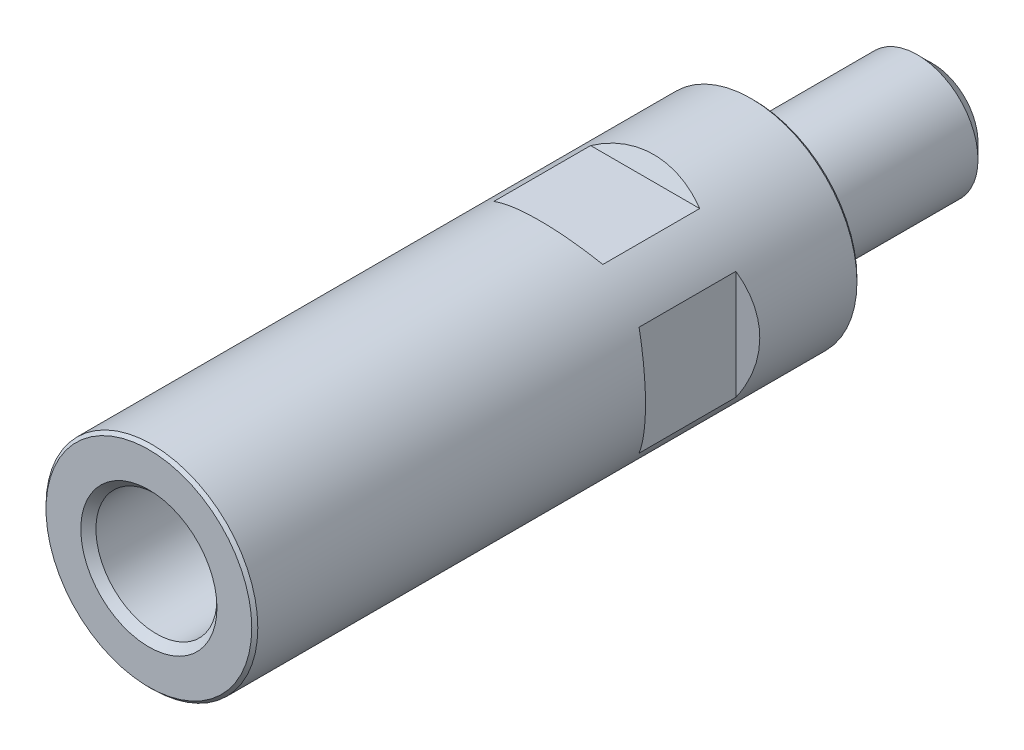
ISO-10303-21;
HEADER;
FILE_DESCRIPTION(('STEP AP214'),'2;1');
FILE_NAME('part.step','',(''),(''),'','','');
FILE_SCHEMA(('AUTOMOTIVE_DESIGN { 1 0 10303 214 1 1 1 1 }'));
ENDSEC;
DATA;
#1=APPLICATION_CONTEXT('core data for automotive mechanical design processes');
#2=APPLICATION_PROTOCOL_DEFINITION('international standard','automotive_design',2000,#1);
#3=PRODUCT_CONTEXT('',#1,'mechanical');
#4=PRODUCT('Part','Part','',(#3));
#5=PRODUCT_RELATED_PRODUCT_CATEGORY('part','',(#4));
#6=PRODUCT_DEFINITION_FORMATION('','',#4);
#7=PRODUCT_DEFINITION_CONTEXT('part definition',#1,'design');
#8=PRODUCT_DEFINITION('design','',#6,#7);
#9=PRODUCT_DEFINITION_SHAPE('','',#8);
#10=(LENGTH_UNIT() NAMED_UNIT(*) SI_UNIT(.MILLI.,.METRE.));
#11=(NAMED_UNIT(*) PLANE_ANGLE_UNIT() SI_UNIT($,.RADIAN.));
#12=(NAMED_UNIT(*) SI_UNIT($,.STERADIAN.) SOLID_ANGLE_UNIT());
#13=UNCERTAINTY_MEASURE_WITH_UNIT(LENGTH_MEASURE(1.E-05),#10,'distance_accuracy_value','');
#14=(GEOMETRIC_REPRESENTATION_CONTEXT(3) GLOBAL_UNCERTAINTY_ASSIGNED_CONTEXT((#13)) GLOBAL_UNIT_ASSIGNED_CONTEXT((#10,
#11,#12)) REPRESENTATION_CONTEXT('',''));
#15=CARTESIAN_POINT('',(0.,0.,0.));
#16=DIRECTION('',(0.,0.,1.));
#17=DIRECTION('',(1.,0.,0.));
#18=AXIS2_PLACEMENT_3D('',#15,#16,#17);
#19=CARTESIAN_POINT('',(0.,0.,2.5));
#20=DIRECTION('',(0.,0.,-1.));
#21=DIRECTION('',(-1.,0.,0.));
#22=AXIS2_PLACEMENT_3D('',#19,#20,#21);
#23=CONICAL_SURFACE('',#22,8.75,0.785398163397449);
#24=CARTESIAN_POINT('',(0.,0.,0.));
#25=DIRECTION('',(0.,0.,1.));
#26=DIRECTION('',(1.,0.,0.));
#27=AXIS2_PLACEMENT_3D('',#24,#25,#26);
#28=CIRCLE('',#27,11.25);
#29=CARTESIAN_POINT('',(11.25,0.,0.));
#30=VERTEX_POINT('',#29);
#31=EDGE_CURVE('E106',#30,#30,#28,.T.);
#32=ORIENTED_EDGE('',*,*,#31,.F.);
#33=EDGE_LOOP('',(#32));
#34=FACE_BOUND('',#33,.T.);
#35=CARTESIAN_POINT('',(0.,0.,1.25));
#36=DIRECTION('',(0.,0.,-1.));
#37=DIRECTION('',(-1.,0.,0.));
#38=AXIS2_PLACEMENT_3D('',#35,#36,#37);
#39=CIRCLE('',#38,10.);
#40=CARTESIAN_POINT('',(-10.,0.,1.25));
#41=VERTEX_POINT('',#40);
#42=EDGE_CURVE('E10',#41,#41,#39,.T.);
#43=ORIENTED_EDGE('',*,*,#42,.F.);
#44=EDGE_LOOP('',(#43));
#45=FACE_BOUND('',#44,.T.);
#46=ADVANCED_FACE('F16',(#34,#45),#23,.F.);
#47=CARTESIAN_POINT('',(0.,0.,100.));
#48=DIRECTION('',(0.,0.,-1.));
#49=DIRECTION('',(-1.,0.,0.));
#50=AXIS2_PLACEMENT_3D('',#47,#48,#49);
#51=CYLINDRICAL_SURFACE('',#50,17.5);
#52=CARTESIAN_POINT('',(0.,0.,0.499999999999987));
#53=DIRECTION('',(0.,0.,1.));
#54=DIRECTION('',(1.,0.,0.));
#55=AXIS2_PLACEMENT_3D('',#52,#53,#54);
#56=CIRCLE('',#55,17.5);
#57=CARTESIAN_POINT('',(17.5,0.,0.499999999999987));
#58=VERTEX_POINT('',#57);
#59=EDGE_CURVE('E163',#58,#58,#56,.T.);
#60=ORIENTED_EDGE('',*,*,#59,.T.);
#61=EDGE_LOOP('',(#60));
#62=FACE_BOUND('',#61,.T.);
#63=CARTESIAN_POINT('',(0.,0.,99.5));
#64=DIRECTION('',(0.,0.,1.));
#65=DIRECTION('',(1.,0.,0.));
#66=AXIS2_PLACEMENT_3D('',#63,#64,#65);
#67=CIRCLE('',#66,17.5);
#68=CARTESIAN_POINT('',(17.5,0.,99.5));
#69=VERTEX_POINT('',#68);
#70=EDGE_CURVE('E102',#69,#69,#67,.F.);
#71=ORIENTED_EDGE('',*,*,#70,.T.);
#72=EDGE_LOOP('',(#71));
#73=FACE_BOUND('',#72,.T.);
#74=CARTESIAN_POINT('',(0.,0.,26.6602540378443));
#75=DIRECTION('',(0.5,0.,-0.86602540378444));
#76=DIRECTION('',(-0.86602540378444,0.,-0.5));
#77=AXIS2_PLACEMENT_3D('',#74,#75,#76);
#78=ELLIPSE('',#77,20.2072594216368,17.5);
#79=CARTESIAN_POINT('',(-15.,-9.01387818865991,18.));
#80=VERTEX_POINT('',#79);
#81=CARTESIAN_POINT('',(-15.,9.01387818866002,18.));
#82=VERTEX_POINT('',#81);
#83=EDGE_CURVE('E84',#80,#82,#78,.T.);
#84=ORIENTED_EDGE('',*,*,#83,.T.);
#85=DIRECTION('',(0.,0.,-1.));
#86=VECTOR('',#85,1.);
#87=CARTESIAN_POINT('',(-15.,9.01387818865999,100.));
#88=LINE('',#87,#86);
#89=CARTESIAN_POINT('',(-15.,9.01387818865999,34.));
#90=VERTEX_POINT('',#89);
#91=EDGE_CURVE('E89',#82,#90,#88,.F.);
#92=ORIENTED_EDGE('',*,*,#91,.T.);
#93=CARTESIAN_POINT('',(0.,0.,25.3397459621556));
#94=DIRECTION('',(0.5,0.,0.86602540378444));
#95=DIRECTION('',(0.86602540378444,0.,-0.5));
#96=AXIS2_PLACEMENT_3D('',#93,#94,#95);
#97=ELLIPSE('',#96,20.2072594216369,17.5);
#98=CARTESIAN_POINT('',(-15.,-9.01387818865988,34.));
#99=VERTEX_POINT('',#98);
#100=EDGE_CURVE('E103',#90,#99,#97,.T.);
#101=ORIENTED_EDGE('',*,*,#100,.T.);
#102=DIRECTION('',(0.,0.,-1.));
#103=VECTOR('',#102,1.);
#104=CARTESIAN_POINT('',(-15.,-9.01387818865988,100.));
#105=LINE('',#104,#103);
#106=EDGE_CURVE('E90',#99,#80,#105,.T.);
#107=ORIENTED_EDGE('',*,*,#106,.T.);
#108=EDGE_LOOP('',(#84,#92,#101,#107));
#109=FACE_BOUND('',#108,.T.);
#110=CARTESIAN_POINT('',(0.,0.,26.6602540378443));
#111=DIRECTION('',(-0.5,0.,-0.86602540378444));
#112=DIRECTION('',(0.86602540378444,0.,-0.5));
#113=AXIS2_PLACEMENT_3D('',#110,#111,#112);
#114=ELLIPSE('',#113,20.2072594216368,17.5);
#115=CARTESIAN_POINT('',(15.,9.01387818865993,18.));
#116=VERTEX_POINT('',#115);
#117=CARTESIAN_POINT('',(15.,-9.01387818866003,18.));
#118=VERTEX_POINT('',#117);
#119=EDGE_CURVE('E94',#116,#118,#114,.T.);
#120=ORIENTED_EDGE('',*,*,#119,.T.);
#121=DIRECTION('',(0.,0.,-1.));
#122=VECTOR('',#121,1.);
#123=CARTESIAN_POINT('',(15.,-9.01387818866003,100.));
#124=LINE('',#123,#122);
#125=CARTESIAN_POINT('',(15.,-9.01387818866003,34.));
#126=VERTEX_POINT('',#125);
#127=EDGE_CURVE('E152',#118,#126,#124,.F.);
#128=ORIENTED_EDGE('',*,*,#127,.T.);
#129=CARTESIAN_POINT('',(0.,0.,25.3397459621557));
#130=DIRECTION('',(-0.5,0.,0.86602540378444));
#131=DIRECTION('',(-0.86602540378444,0.,-0.5));
#132=AXIS2_PLACEMENT_3D('',#129,#130,#131);
#133=ELLIPSE('',#132,20.2072594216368,17.5);
#134=CARTESIAN_POINT('',(15.,9.01387818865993,34.));
#135=VERTEX_POINT('',#134);
#136=EDGE_CURVE('E149',#126,#135,#133,.T.);
#137=ORIENTED_EDGE('',*,*,#136,.T.);
#138=DIRECTION('',(0.,0.,-1.));
#139=VECTOR('',#138,1.);
#140=CARTESIAN_POINT('',(15.,9.01387818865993,100.));
#141=LINE('',#140,#139);
#142=EDGE_CURVE('E155',#135,#116,#141,.T.);
#143=ORIENTED_EDGE('',*,*,#142,.T.);
#144=EDGE_LOOP('',(#120,#128,#137,#143));
#145=FACE_BOUND('',#144,.T.);
#146=CARTESIAN_POINT('',(0.,0.,26.6602540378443));
#147=DIRECTION('',(0.,0.5,-0.86602540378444));
#148=DIRECTION('',(0.,-0.86602540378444,-0.5));
#149=AXIS2_PLACEMENT_3D('',#146,#147,#148);
#150=ELLIPSE('',#149,20.2072594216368,17.5);
#151=CARTESIAN_POINT('',(9.01387818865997,-15.,18.));
#152=VERTEX_POINT('',#151);
#153=CARTESIAN_POINT('',(-9.01387818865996,-15.,18.));
#154=VERTEX_POINT('',#153);
#155=EDGE_CURVE('E138',#152,#154,#150,.T.);
#156=ORIENTED_EDGE('',*,*,#155,.T.);
#157=DIRECTION('',(0.,0.,-1.));
#158=VECTOR('',#157,1.);
#159=CARTESIAN_POINT('',(-9.01387818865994,-15.,100.));
#160=LINE('',#159,#158);
#161=CARTESIAN_POINT('',(-9.01387818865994,-15.,34.));
#162=VERTEX_POINT('',#161);
#163=EDGE_CURVE('E146',#154,#162,#160,.F.);
#164=ORIENTED_EDGE('',*,*,#163,.T.);
#165=CARTESIAN_POINT('',(0.,0.,25.3397459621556));
#166=DIRECTION('',(0.,0.5,0.86602540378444));
#167=DIRECTION('',(0.,0.86602540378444,-0.5));
#168=AXIS2_PLACEMENT_3D('',#165,#166,#167);
#169=ELLIPSE('',#168,20.2072594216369,17.5);
#170=CARTESIAN_POINT('',(9.01387818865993,-15.,34.));
#171=VERTEX_POINT('',#170);
#172=EDGE_CURVE('E143',#162,#171,#169,.T.);
#173=ORIENTED_EDGE('',*,*,#172,.T.);
#174=DIRECTION('',(0.,0.,-1.));
#175=VECTOR('',#174,1.);
#176=CARTESIAN_POINT('',(9.01387818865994,-15.,100.));
#177=LINE('',#176,#175);
#178=EDGE_CURVE('E140',#171,#152,#177,.T.);
#179=ORIENTED_EDGE('',*,*,#178,.T.);
#180=EDGE_LOOP('',(#156,#164,#173,#179));
#181=FACE_BOUND('',#180,.T.);
#182=CARTESIAN_POINT('',(0.,0.,26.6602540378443));
#183=DIRECTION('',(0.,-0.5,-0.86602540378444));
#184=DIRECTION('',(0.,0.86602540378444,-0.5));
#185=AXIS2_PLACEMENT_3D('',#182,#183,#184);
#186=ELLIPSE('',#185,20.2072594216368,17.5);
#187=CARTESIAN_POINT('',(-9.01387818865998,15.,18.));
#188=VERTEX_POINT('',#187);
#189=CARTESIAN_POINT('',(9.01387818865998,15.,18.));
#190=VERTEX_POINT('',#189);
#191=EDGE_CURVE('E136',#188,#190,#186,.T.);
#192=ORIENTED_EDGE('',*,*,#191,.T.);
#193=DIRECTION('',(0.,0.,-1.));
#194=VECTOR('',#193,1.);
#195=CARTESIAN_POINT('',(9.01387818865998,15.,100.));
#196=LINE('',#195,#194);
#197=CARTESIAN_POINT('',(9.01387818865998,15.,34.));
#198=VERTEX_POINT('',#197);
#199=EDGE_CURVE('E130',#190,#198,#196,.F.);
#200=ORIENTED_EDGE('',*,*,#199,.T.);
#201=CARTESIAN_POINT('',(0.,0.,25.3397459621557));
#202=DIRECTION('',(0.,-0.5,0.86602540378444));
#203=DIRECTION('',(0.,-0.86602540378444,-0.5));
#204=AXIS2_PLACEMENT_3D('',#201,#202,#203);
#205=ELLIPSE('',#204,20.2072594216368,17.5);
#206=CARTESIAN_POINT('',(-9.01387818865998,15.,34.));
#207=VERTEX_POINT('',#206);
#208=EDGE_CURVE('E126',#198,#207,#205,.T.);
#209=ORIENTED_EDGE('',*,*,#208,.T.);
#210=DIRECTION('',(0.,0.,-1.));
#211=VECTOR('',#210,1.);
#212=CARTESIAN_POINT('',(-9.01387818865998,15.,100.));
#213=LINE('',#212,#211);
#214=EDGE_CURVE('E133',#207,#188,#213,.T.);
#215=ORIENTED_EDGE('',*,*,#214,.T.);
#216=EDGE_LOOP('',(#192,#200,#209,#215));
#217=FACE_BOUND('',#216,.T.);
#218=ADVANCED_FACE('F86',(#62,#73,#109,#145,#181,#217),#51,.T.);
#219=CARTESIAN_POINT('',(0.,0.,100.));
#220=DIRECTION('',(0.,0.,1.));
#221=DIRECTION('',(1.,0.,0.));
#222=AXIS2_PLACEMENT_3D('',#219,#220,#221);
#223=PLANE('',#222);
#224=CARTESIAN_POINT('',(0.,0.,100.));
#225=DIRECTION('',(0.,0.,1.));
#226=DIRECTION('',(1.,0.,0.));
#227=AXIS2_PLACEMENT_3D('',#224,#225,#226);
#228=CIRCLE('',#227,17.);
#229=CARTESIAN_POINT('',(17.,0.,100.));
#230=VERTEX_POINT('',#229);
#231=EDGE_CURVE('E26',#230,#230,#228,.T.);
#232=ORIENTED_EDGE('',*,*,#231,.T.);
#233=EDGE_LOOP('',(#232));
#234=FACE_BOUND('',#233,.T.);
#235=CARTESIAN_POINT('',(0.,0.,100.));
#236=DIRECTION('',(0.,0.,1.));
#237=DIRECTION('',(1.,0.,0.));
#238=AXIS2_PLACEMENT_3D('',#235,#236,#237);
#239=CIRCLE('',#238,11.25);
#240=CARTESIAN_POINT('',(11.25,0.,100.));
#241=VERTEX_POINT('',#240);
#242=EDGE_CURVE('E110',#241,#241,#239,.T.);
#243=ORIENTED_EDGE('',*,*,#242,.F.);
#244=EDGE_LOOP('',(#243));
#245=FACE_BOUND('',#244,.T.);
#246=ADVANCED_FACE('F230',(#234,#245),#223,.T.);
#247=CARTESIAN_POINT('',(0.,0.,0.));
#248=DIRECTION('',(0.,0.,1.));
#249=DIRECTION('',(1.,0.,0.));
#250=AXIS2_PLACEMENT_3D('',#247,#248,#249);
#251=PLANE('',#250);
#252=CARTESIAN_POINT('',(0.,0.,0.));
#253=DIRECTION('',(0.,0.,1.));
#254=DIRECTION('',(1.,0.,0.));
#255=AXIS2_PLACEMENT_3D('',#252,#253,#254);
#256=CIRCLE('',#255,17.);
#257=CARTESIAN_POINT('',(17.,0.,0.));
#258=VERTEX_POINT('',#257);
#259=EDGE_CURVE('E166',#258,#258,#256,.F.);
#260=ORIENTED_EDGE('',*,*,#259,.T.);
#261=EDGE_LOOP('',(#260));
#262=FACE_BOUND('',#261,.T.);
#263=ORIENTED_EDGE('',*,*,#31,.T.);
#264=EDGE_LOOP('',(#263));
#265=FACE_BOUND('',#264,.T.);
#266=ADVANCED_FACE('F273',(#262,#265),#251,.F.);
#267=CARTESIAN_POINT('',(-10.,15.,18.));
#268=DIRECTION('',(0.,-0.5,-0.86602540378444));
#269=DIRECTION('',(0.,0.86602540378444,-0.5));
#270=AXIS2_PLACEMENT_3D('',#267,#268,#269);
#271=PLANE('',#270);
#272=ORIENTED_EDGE('',*,*,#191,.F.);
#273=DIRECTION('',(1.,0.,0.));
#274=VECTOR('',#273,1.);
#275=CARTESIAN_POINT('',(-10.,15.,18.));
#276=LINE('',#275,#274);
#277=EDGE_CURVE('E123',#188,#190,#276,.T.);
#278=ORIENTED_EDGE('',*,*,#277,.T.);
#279=EDGE_LOOP('',(#272,#278));
#280=FACE_BOUND('',#279,.T.);
#281=ADVANCED_FACE('F269',(#280),#271,.F.);
#282=CARTESIAN_POINT('',(-10.,15.,34.));
#283=DIRECTION('',(0.,-1.,0.));
#284=DIRECTION('',(0.,0.,-1.));
#285=AXIS2_PLACEMENT_3D('',#282,#283,#284);
#286=PLANE('',#285);
#287=DIRECTION('',(1.,0.,0.));
#288=VECTOR('',#287,1.);
#289=CARTESIAN_POINT('',(-10.,15.,34.));
#290=LINE('',#289,#288);
#291=EDGE_CURVE('E40',#207,#198,#290,.T.);
#292=ORIENTED_EDGE('',*,*,#291,.T.);
#293=ORIENTED_EDGE('',*,*,#199,.F.);
#294=ORIENTED_EDGE('',*,*,#277,.F.);
#295=ORIENTED_EDGE('',*,*,#214,.F.);
#296=EDGE_LOOP('',(#292,#293,#294,#295));
#297=FACE_BOUND('',#296,.T.);
#298=ADVANCED_FACE('F272',(#297),#286,.F.);
#299=CARTESIAN_POINT('',(-10.,17.5,35.443375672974));
#300=DIRECTION('',(0.,-0.5,0.86602540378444));
#301=DIRECTION('',(0.,-0.86602540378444,-0.5));
#302=AXIS2_PLACEMENT_3D('',#299,#300,#301);
#303=PLANE('',#302);
#304=ORIENTED_EDGE('',*,*,#291,.F.);
#305=ORIENTED_EDGE('',*,*,#208,.F.);
#306=EDGE_LOOP('',(#304,#305));
#307=FACE_BOUND('',#306,.T.);
#308=ADVANCED_FACE('F267',(#307),#303,.F.);
#309=CARTESIAN_POINT('',(-10.,-17.5,35.443375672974));
#310=DIRECTION('',(0.,0.5,0.86602540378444));
#311=DIRECTION('',(0.,-0.86602540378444,0.5));
#312=AXIS2_PLACEMENT_3D('',#309,#310,#311);
#313=PLANE('',#312);
#314=DIRECTION('',(1.,0.,0.));
#315=VECTOR('',#314,1.);
#316=CARTESIAN_POINT('',(-10.,-15.,34.));
#317=LINE('',#316,#315);
#318=EDGE_CURVE('E118',#162,#171,#317,.T.);
#319=ORIENTED_EDGE('',*,*,#318,.T.);
#320=ORIENTED_EDGE('',*,*,#172,.F.);
#321=EDGE_LOOP('',(#319,#320));
#322=FACE_BOUND('',#321,.T.);
#323=ADVANCED_FACE('F260',(#322),#313,.F.);
#324=CARTESIAN_POINT('',(-10.,-15.,34.));
#325=DIRECTION('',(0.,1.,0.));
#326=DIRECTION('',(0.,0.,1.));
#327=AXIS2_PLACEMENT_3D('',#324,#325,#326);
#328=PLANE('',#327);
#329=ORIENTED_EDGE('',*,*,#318,.F.);
#330=ORIENTED_EDGE('',*,*,#163,.F.);
#331=DIRECTION('',(1.,0.,0.));
#332=VECTOR('',#331,1.);
#333=CARTESIAN_POINT('',(-10.,-15.,18.));
#334=LINE('',#333,#332);
#335=EDGE_CURVE('E116',#154,#152,#334,.T.);
#336=ORIENTED_EDGE('',*,*,#335,.T.);
#337=ORIENTED_EDGE('',*,*,#178,.F.);
#338=EDGE_LOOP('',(#329,#330,#336,#337));
#339=FACE_BOUND('',#338,.T.);
#340=ADVANCED_FACE('F257',(#339),#328,.F.);
#341=CARTESIAN_POINT('',(-10.,-15.,18.));
#342=DIRECTION('',(0.,0.5,-0.86602540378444));
#343=DIRECTION('',(0.,0.86602540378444,0.5));
#344=AXIS2_PLACEMENT_3D('',#341,#342,#343);
#345=PLANE('',#344);
#346=ORIENTED_EDGE('',*,*,#155,.F.);
#347=ORIENTED_EDGE('',*,*,#335,.F.);
#348=EDGE_LOOP('',(#346,#347));
#349=FACE_BOUND('',#348,.T.);
#350=ADVANCED_FACE('F250',(#349),#345,.F.);
#351=CARTESIAN_POINT('',(15.,10.,18.));
#352=DIRECTION('',(-0.5,0.,-0.86602540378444));
#353=DIRECTION('',(-0.86602540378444,0.,0.5));
#354=AXIS2_PLACEMENT_3D('',#351,#352,#353);
#355=PLANE('',#354);
#356=ORIENTED_EDGE('',*,*,#119,.F.);
#357=DIRECTION('',(0.,-1.,0.));
#358=VECTOR('',#357,1.);
#359=CARTESIAN_POINT('',(15.,10.,18.));
#360=LINE('',#359,#358);
#361=EDGE_CURVE('E113',#116,#118,#360,.T.);
#362=ORIENTED_EDGE('',*,*,#361,.T.);
#363=EDGE_LOOP('',(#356,#362));
#364=FACE_BOUND('',#363,.T.);
#365=ADVANCED_FACE('F246',(#364),#355,.F.);
#366=CARTESIAN_POINT('',(15.,10.,34.));
#367=DIRECTION('',(-1.,0.,0.));
#368=DIRECTION('',(0.,-1.,0.));
#369=AXIS2_PLACEMENT_3D('',#366,#367,#368);
#370=PLANE('',#369);
#371=DIRECTION('',(0.,-1.,0.));
#372=VECTOR('',#371,1.);
#373=CARTESIAN_POINT('',(15.,10.,34.));
#374=LINE('',#373,#372);
#375=EDGE_CURVE('E33',#135,#126,#374,.T.);
#376=ORIENTED_EDGE('',*,*,#375,.T.);
#377=ORIENTED_EDGE('',*,*,#127,.F.);
#378=ORIENTED_EDGE('',*,*,#361,.F.);
#379=ORIENTED_EDGE('',*,*,#142,.F.);
#380=EDGE_LOOP('',(#376,#377,#378,#379));
#381=FACE_BOUND('',#380,.T.);
#382=ADVANCED_FACE('F249',(#381),#370,.F.);
#383=CARTESIAN_POINT('',(17.5,10.,35.443375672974));
#384=DIRECTION('',(-0.5,0.,0.86602540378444));
#385=DIRECTION('',(0.86602540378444,0.,0.5));
#386=AXIS2_PLACEMENT_3D('',#383,#384,#385);
#387=PLANE('',#386);
#388=ORIENTED_EDGE('',*,*,#375,.F.);
#389=ORIENTED_EDGE('',*,*,#136,.F.);
#390=EDGE_LOOP('',(#388,#389));
#391=FACE_BOUND('',#390,.T.);
#392=ADVANCED_FACE('F244',(#391),#387,.F.);
#393=CARTESIAN_POINT('',(-17.5,10.,35.443375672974));
#394=DIRECTION('',(0.5,0.,0.86602540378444));
#395=DIRECTION('',(0.86602540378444,0.,-0.5));
#396=AXIS2_PLACEMENT_3D('',#393,#394,#395);
#397=PLANE('',#396);
#398=DIRECTION('',(0.,-1.,0.));
#399=VECTOR('',#398,1.);
#400=CARTESIAN_POINT('',(-15.,10.,34.));
#401=LINE('',#400,#399);
#402=EDGE_CURVE('E101',#90,#99,#401,.T.);
#403=ORIENTED_EDGE('',*,*,#402,.T.);
#404=ORIENTED_EDGE('',*,*,#100,.F.);
#405=EDGE_LOOP('',(#403,#404));
#406=FACE_BOUND('',#405,.T.);
#407=ADVANCED_FACE('F239',(#406),#397,.F.);
#408=CARTESIAN_POINT('',(-15.,10.,34.));
#409=DIRECTION('',(1.,0.,0.));
#410=DIRECTION('',(0.,1.,0.));
#411=AXIS2_PLACEMENT_3D('',#408,#409,#410);
#412=PLANE('',#411);
#413=ORIENTED_EDGE('',*,*,#402,.F.);
#414=ORIENTED_EDGE('',*,*,#91,.F.);
#415=DIRECTION('',(0.,-1.,0.));
#416=VECTOR('',#415,1.);
#417=CARTESIAN_POINT('',(-15.,10.,18.));
#418=LINE('',#417,#416);
#419=EDGE_CURVE('E99',#82,#80,#418,.T.);
#420=ORIENTED_EDGE('',*,*,#419,.T.);
#421=ORIENTED_EDGE('',*,*,#106,.F.);
#422=EDGE_LOOP('',(#413,#414,#420,#421));
#423=FACE_BOUND('',#422,.T.);
#424=ADVANCED_FACE('F98',(#423),#412,.F.);
#425=CARTESIAN_POINT('',(-15.,10.,18.));
#426=DIRECTION('',(0.5,0.,-0.86602540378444));
#427=DIRECTION('',(-0.86602540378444,0.,-0.5));
#428=AXIS2_PLACEMENT_3D('',#425,#426,#427);
#429=PLANE('',#428);
#430=ORIENTED_EDGE('',*,*,#83,.F.);
#431=ORIENTED_EDGE('',*,*,#419,.F.);
#432=EDGE_LOOP('',(#430,#431));
#433=FACE_BOUND('',#432,.T.);
#434=ADVANCED_FACE('F105',(#433),#429,.F.);
#435=CARTESIAN_POINT('',(0.,0.,100.));
#436=DIRECTION('',(0.,0.,1.));
#437=DIRECTION('',(1.,0.,0.));
#438=AXIS2_PLACEMENT_3D('',#435,#436,#437);
#439=CONICAL_SURFACE('',#438,11.25,0.785398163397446);
#440=CARTESIAN_POINT('',(0.,0.,98.75));
#441=DIRECTION('',(0.,0.,1.));
#442=DIRECTION('',(1.,0.,0.));
#443=AXIS2_PLACEMENT_3D('',#440,#441,#442);
#444=CIRCLE('',#443,10.);
#445=CARTESIAN_POINT('',(10.,0.,98.75));
#446=VERTEX_POINT('',#445);
#447=EDGE_CURVE('E171',#446,#446,#444,.F.);
#448=ORIENTED_EDGE('',*,*,#447,.T.);
#449=EDGE_LOOP('',(#448));
#450=FACE_BOUND('',#449,.T.);
#451=ORIENTED_EDGE('',*,*,#242,.T.);
#452=EDGE_LOOP('',(#451));
#453=FACE_BOUND('',#452,.T.);
#454=ADVANCED_FACE('F236',(#450,#453),#439,.F.);
#455=CARTESIAN_POINT('',(0.,0.,0.499999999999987));
#456=DIRECTION('',(0.,0.,1.));
#457=DIRECTION('',(1.,0.,0.));
#458=AXIS2_PLACEMENT_3D('',#455,#456,#457);
#459=CONICAL_SURFACE('',#458,17.5,0.785398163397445);
#460=ORIENTED_EDGE('',*,*,#259,.F.);
#461=EDGE_LOOP('',(#460));
#462=FACE_BOUND('',#461,.T.);
#463=ORIENTED_EDGE('',*,*,#59,.F.);
#464=EDGE_LOOP('',(#463));
#465=FACE_BOUND('',#464,.T.);
#466=ADVANCED_FACE('F210',(#462,#465),#459,.T.);
#467=CARTESIAN_POINT('',(0.,0.,100.));
#468=DIRECTION('',(0.,0.,-1.));
#469=DIRECTION('',(-1.,0.,0.));
#470=AXIS2_PLACEMENT_3D('',#467,#468,#469);
#471=CONICAL_SURFACE('',#470,17.,0.785398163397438);
#472=ORIENTED_EDGE('',*,*,#70,.F.);
#473=EDGE_LOOP('',(#472));
#474=FACE_BOUND('',#473,.T.);
#475=ORIENTED_EDGE('',*,*,#231,.F.);
#476=EDGE_LOOP('',(#475));
#477=FACE_BOUND('',#476,.T.);
#478=ADVANCED_FACE('F203',(#474,#477),#471,.T.);
#479=CARTESIAN_POINT('',(0.,0.,21.));
#480=DIRECTION('',(0.,0.,1.));
#481=DIRECTION('',(1.,0.,0.));
#482=AXIS2_PLACEMENT_3D('',#479,#480,#481);
#483=CYLINDRICAL_SURFACE('',#482,10.);
#484=CARTESIAN_POINT('',(0.,0.,50.));
#485=DIRECTION('',(0.,0.,1.));
#486=DIRECTION('',(1.,0.,0.));
#487=AXIS2_PLACEMENT_3D('',#484,#485,#486);
#488=CIRCLE('',#487,10.);
#489=CARTESIAN_POINT('',(10.,0.,50.));
#490=VERTEX_POINT('',#489);
#491=EDGE_CURVE('E182',#490,#490,#488,.T.);
#492=ORIENTED_EDGE('',*,*,#491,.F.);
#493=EDGE_LOOP('',(#492));
#494=FACE_BOUND('',#493,.T.);
#495=ORIENTED_EDGE('',*,*,#447,.F.);
#496=EDGE_LOOP('',(#495));
#497=FACE_BOUND('',#496,.T.);
#498=ADVANCED_FACE('F196',(#494,#497),#483,.F.);
#499=CARTESIAN_POINT('',(0.,0.,-29.5));
#500=DIRECTION('',(0.,0.,1.));
#501=DIRECTION('',(1.,0.,0.));
#502=AXIS2_PLACEMENT_3D('',#499,#500,#501);
#503=PLANE('',#502);
#504=CARTESIAN_POINT('',(0.,0.,-29.5));
#505=DIRECTION('',(0.,0.,1.));
#506=DIRECTION('',(1.,0.,0.));
#507=AXIS2_PLACEMENT_3D('',#504,#505,#506);
#508=CIRCLE('',#507,7.5);
#509=CARTESIAN_POINT('',(7.5,0.,-29.5));
#510=VERTEX_POINT('',#509);
#511=EDGE_CURVE('E20',#510,#510,#508,.T.);
#512=ORIENTED_EDGE('',*,*,#511,.F.);
#513=EDGE_LOOP('',(#512));
#514=FACE_BOUND('',#513,.T.);
#515=ADVANCED_FACE('F18',(#514),#503,.F.);
#516=CARTESIAN_POINT('',(0.,0.,-27.));
#517=DIRECTION('',(0.,0.,1.));
#518=DIRECTION('',(1.,0.,0.));
#519=AXIS2_PLACEMENT_3D('',#516,#517,#518);
#520=CONICAL_SURFACE('',#519,10.,0.785398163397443);
#521=ORIENTED_EDGE('',*,*,#511,.T.);
#522=EDGE_LOOP('',(#521));
#523=FACE_BOUND('',#522,.T.);
#524=CARTESIAN_POINT('',(0.,0.,-27.));
#525=DIRECTION('',(0.,0.,1.));
#526=DIRECTION('',(1.,0.,0.));
#527=AXIS2_PLACEMENT_3D('',#524,#525,#526);
#528=CIRCLE('',#527,10.);
#529=CARTESIAN_POINT('',(10.,0.,-27.));
#530=VERTEX_POINT('',#529);
#531=EDGE_CURVE('E174',#530,#530,#528,.T.);
#532=ORIENTED_EDGE('',*,*,#531,.F.);
#533=EDGE_LOOP('',(#532));
#534=FACE_BOUND('',#533,.T.);
#535=ADVANCED_FACE('F192',(#523,#534),#520,.T.);
#536=CARTESIAN_POINT('',(0.,0.,-9.5));
#537=DIRECTION('',(0.,0.,1.));
#538=DIRECTION('',(1.,0.,0.));
#539=AXIS2_PLACEMENT_3D('',#536,#537,#538);
#540=CYLINDRICAL_SURFACE('',#539,10.);
#541=ORIENTED_EDGE('',*,*,#531,.T.);
#542=EDGE_LOOP('',(#541));
#543=FACE_BOUND('',#542,.T.);
#544=ORIENTED_EDGE('',*,*,#42,.T.);
#545=EDGE_LOOP('',(#544));
#546=FACE_BOUND('',#545,.T.);
#547=ADVANCED_FACE('F202',(#543,#546),#540,.T.);
#548=CARTESIAN_POINT('',(0.,0.,50.));
#549=DIRECTION('',(0.,0.,1.));
#550=DIRECTION('',(1.,0.,0.));
#551=AXIS2_PLACEMENT_3D('',#548,#549,#550);
#552=PLANE('',#551);
#553=ORIENTED_EDGE('',*,*,#491,.T.);
#554=EDGE_LOOP('',(#553));
#555=FACE_BOUND('',#554,.T.);
#556=ADVANCED_FACE('F206',(#555),#552,.T.);
#557=CLOSED_SHELL('',(#46,#218,#246,#266,#281,#298,#308,#323,#340,#350,#365,#382,#392,#407,#424,
#434,#454,#466,#478,#498,#515,#535,#547,#556));
#558=MANIFOLD_SOLID_BREP('B1',#557);
#559=ADVANCED_BREP_SHAPE_REPRESENTATION('',(#18,#558),#14);
#560=SHAPE_DEFINITION_REPRESENTATION(#9,#559);
ENDSEC;
END-ISO-10303-21;
